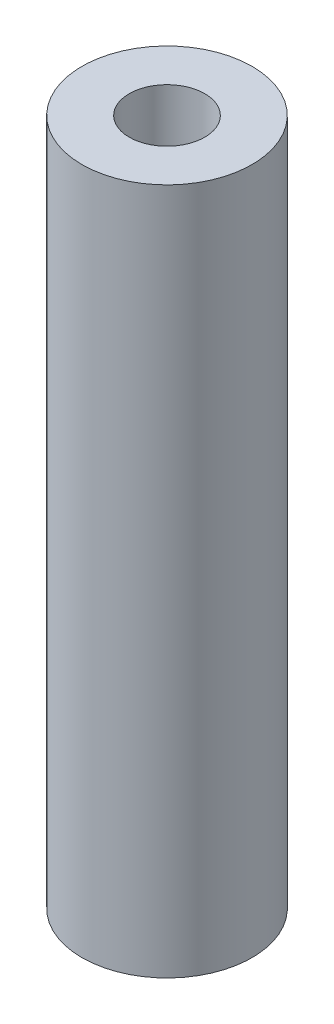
from build123d import *

# Parameters (mm, degrees)
SKETCH1_R           = 3.1
SKETCH1_R_2         = 1.375
BOSS_EXTRUDE1_DEPTH = 25.024999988


with BuildPart() as part:
    # Sketch1 → Boss-Extrude1 (new body)
    with BuildSketch(Plane(origin=(0, 0, 0), x_dir=(1, 0, 0), z_dir=(0, 1, 0))):
        with Locations(Location((0, 0, 0), (0, 0, 270))):
            Circle(SKETCH1_R)
        with Locations(Location((0, 0, 0), (0, 0, 270))):
            Circle(SKETCH1_R_2, mode=Mode.SUBTRACT)
    extrude(amount=BOSS_EXTRUDE1_DEPTH)


solid = part.part
